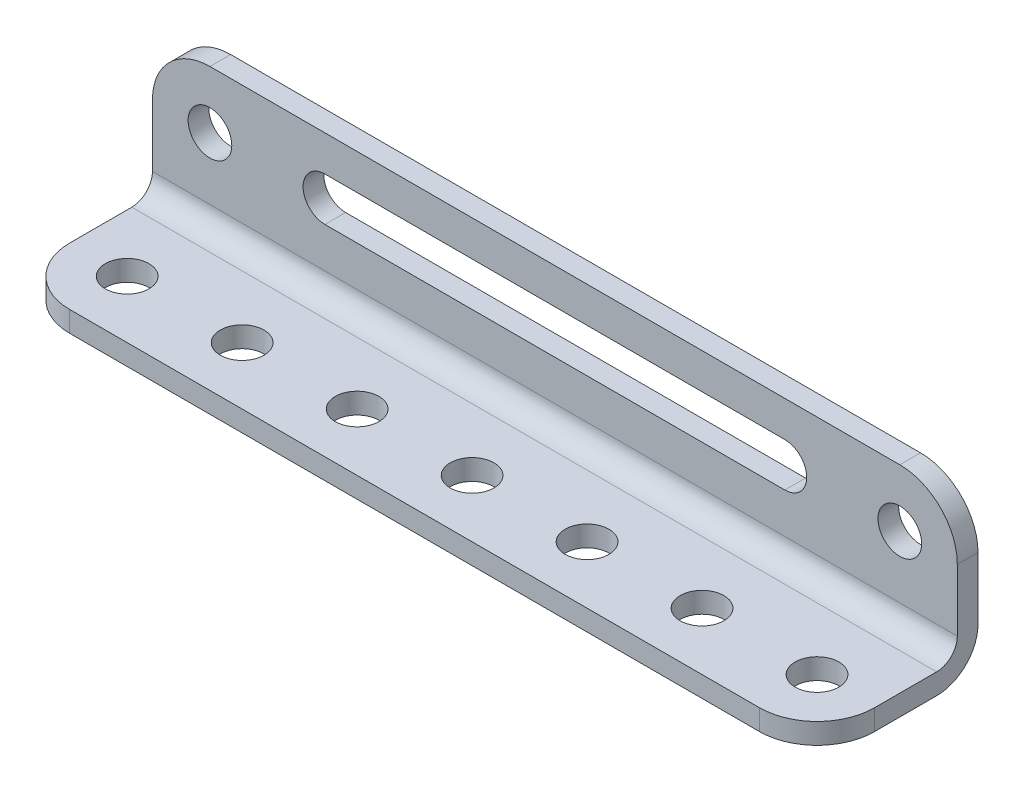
ISO-10303-21;
HEADER;
FILE_DESCRIPTION(('STEP AP214'),'2;1');
FILE_NAME('part.step','',(''),(''),'','','');
FILE_SCHEMA(('AUTOMOTIVE_DESIGN { 1 0 10303 214 1 1 1 1 }'));
ENDSEC;
DATA;
#1=APPLICATION_CONTEXT('core data for automotive mechanical design processes');
#2=APPLICATION_PROTOCOL_DEFINITION('international standard','automotive_design',2000,#1);
#3=PRODUCT_CONTEXT('',#1,'mechanical');
#4=PRODUCT('Part','Part','',(#3));
#5=PRODUCT_RELATED_PRODUCT_CATEGORY('part','',(#4));
#6=PRODUCT_DEFINITION_FORMATION('','',#4);
#7=PRODUCT_DEFINITION_CONTEXT('part definition',#1,'design');
#8=PRODUCT_DEFINITION('design','',#6,#7);
#9=PRODUCT_DEFINITION_SHAPE('','',#8);
#10=(LENGTH_UNIT() NAMED_UNIT(*) SI_UNIT(.MILLI.,.METRE.));
#11=(NAMED_UNIT(*) PLANE_ANGLE_UNIT() SI_UNIT($,.RADIAN.));
#12=(NAMED_UNIT(*) SI_UNIT($,.STERADIAN.) SOLID_ANGLE_UNIT());
#13=UNCERTAINTY_MEASURE_WITH_UNIT(LENGTH_MEASURE(1.E-05),#10,'distance_accuracy_value','');
#14=(GEOMETRIC_REPRESENTATION_CONTEXT(3) GLOBAL_UNCERTAINTY_ASSIGNED_CONTEXT((#13)) GLOBAL_UNIT_ASSIGNED_CONTEXT((#10,
#11,#12)) REPRESENTATION_CONTEXT('',''));
#15=CARTESIAN_POINT('',(0.,0.,0.));
#16=DIRECTION('',(0.,0.,1.));
#17=DIRECTION('',(1.,0.,0.));
#18=AXIS2_PLACEMENT_3D('',#15,#16,#17);
#19=CARTESIAN_POINT('',(44.45,4.572,-17.78));
#20=DIRECTION('',(0.,0.,1.));
#21=DIRECTION('',(1.,0.,0.));
#22=AXIS2_PLACEMENT_3D('',#19,#20,#21);
#23=PLANE('',#22);
#24=DIRECTION('',(-1.,0.,0.));
#25=VECTOR('',#24,1.);
#26=CARTESIAN_POINT('',(-25.4,13.843,-17.78));
#27=LINE('',#26,#25);
#28=CARTESIAN_POINT('',(25.4,13.843,-17.78));
#29=VERTEX_POINT('',#28);
#30=CARTESIAN_POINT('',(-25.4,13.843,-17.78));
#31=VERTEX_POINT('',#30);
#32=EDGE_CURVE('E170',#29,#31,#27,.T.);
#33=ORIENTED_EDGE('',*,*,#32,.T.);
#34=CARTESIAN_POINT('',(-25.4,11.43,-17.78));
#35=DIRECTION('',(0.,0.,1.));
#36=DIRECTION('',(1.,0.,0.));
#37=AXIS2_PLACEMENT_3D('',#34,#35,#36);
#38=CIRCLE('',#37,2.41299999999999);
#39=CARTESIAN_POINT('',(-25.4,9.017,-17.78));
#40=VERTEX_POINT('',#39);
#41=EDGE_CURVE('E161',#31,#40,#38,.T.);
#42=ORIENTED_EDGE('',*,*,#41,.T.);
#43=DIRECTION('',(1.,0.,0.));
#44=VECTOR('',#43,1.);
#45=CARTESIAN_POINT('',(-25.4,9.017,-17.78));
#46=LINE('',#45,#44);
#47=CARTESIAN_POINT('',(25.4,9.017,-17.78));
#48=VERTEX_POINT('',#47);
#49=EDGE_CURVE('E167',#40,#48,#46,.T.);
#50=ORIENTED_EDGE('',*,*,#49,.T.);
#51=CARTESIAN_POINT('',(25.4,11.43,-17.78));
#52=DIRECTION('',(0.,0.,1.));
#53=DIRECTION('',(-1.,0.,0.));
#54=AXIS2_PLACEMENT_3D('',#51,#52,#53);
#55=CIRCLE('',#54,2.41299999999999);
#56=EDGE_CURVE('E44',#48,#29,#55,.T.);
#57=ORIENTED_EDGE('',*,*,#56,.T.);
#58=EDGE_LOOP('',(#33,#42,#50,#57));
#59=FACE_BOUND('',#58,.T.);
#60=CARTESIAN_POINT('',(38.1,11.43,-17.78));
#61=DIRECTION('',(0.,0.,1.));
#62=DIRECTION('',(1.,0.,0.));
#63=AXIS2_PLACEMENT_3D('',#60,#61,#62);
#64=CIRCLE('',#63,2.41299999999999);
#65=CARTESIAN_POINT('',(40.513,11.43,-17.78));
#66=VERTEX_POINT('',#65);
#67=EDGE_CURVE('E175',#66,#66,#64,.T.);
#68=ORIENTED_EDGE('',*,*,#67,.T.);
#69=EDGE_LOOP('',(#68));
#70=FACE_BOUND('',#69,.T.);
#71=CARTESIAN_POINT('',(-38.1,11.43,-17.78));
#72=DIRECTION('',(0.,0.,1.));
#73=DIRECTION('',(1.,0.,0.));
#74=AXIS2_PLACEMENT_3D('',#71,#72,#73);
#75=CIRCLE('',#74,2.41299999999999);
#76=CARTESIAN_POINT('',(-35.687,11.43,-17.78));
#77=VERTEX_POINT('',#76);
#78=EDGE_CURVE('E186',#77,#77,#75,.T.);
#79=ORIENTED_EDGE('',*,*,#78,.T.);
#80=EDGE_LOOP('',(#79));
#81=FACE_BOUND('',#80,.T.);
#82=DIRECTION('',(0.,1.,0.));
#83=VECTOR('',#82,1.);
#84=CARTESIAN_POINT('',(-44.45,4.572,-17.78));
#85=LINE('',#84,#83);
#86=CARTESIAN_POINT('',(-44.45,4.572,-17.78));
#87=VERTEX_POINT('',#86);
#88=CARTESIAN_POINT('',(-44.45,11.43,-17.78));
#89=VERTEX_POINT('',#88);
#90=EDGE_CURVE('E201',#87,#89,#85,.T.);
#91=ORIENTED_EDGE('',*,*,#90,.T.);
#92=CARTESIAN_POINT('',(-38.1,11.43,-17.78));
#93=DIRECTION('',(0.,0.,1.));
#94=DIRECTION('',(1.,0.,0.));
#95=AXIS2_PLACEMENT_3D('',#92,#93,#94);
#96=CIRCLE('',#95,6.35);
#97=CARTESIAN_POINT('',(-38.1,17.78,-17.78));
#98=VERTEX_POINT('',#97);
#99=EDGE_CURVE('E292',#89,#98,#96,.F.);
#100=ORIENTED_EDGE('',*,*,#99,.T.);
#101=DIRECTION('',(-1.,0.,0.));
#102=VECTOR('',#101,1.);
#103=CARTESIAN_POINT('',(44.45,17.78,-17.78));
#104=LINE('',#103,#102);
#105=CARTESIAN_POINT('',(38.1,17.78,-17.78));
#106=VERTEX_POINT('',#105);
#107=EDGE_CURVE('E251',#106,#98,#104,.T.);
#108=ORIENTED_EDGE('',*,*,#107,.F.);
#109=CARTESIAN_POINT('',(38.1,11.43,-17.78));
#110=DIRECTION('',(0.,0.,1.));
#111=DIRECTION('',(1.,0.,0.));
#112=AXIS2_PLACEMENT_3D('',#109,#110,#111);
#113=CIRCLE('',#112,6.35);
#114=CARTESIAN_POINT('',(44.45,11.43,-17.78));
#115=VERTEX_POINT('',#114);
#116=EDGE_CURVE('E290',#106,#115,#113,.F.);
#117=ORIENTED_EDGE('',*,*,#116,.T.);
#118=DIRECTION('',(0.,1.,0.));
#119=VECTOR('',#118,1.);
#120=CARTESIAN_POINT('',(44.45,4.572,-17.78));
#121=LINE('',#120,#119);
#122=CARTESIAN_POINT('',(44.45,4.572,-17.78));
#123=VERTEX_POINT('',#122);
#124=EDGE_CURVE('E216',#123,#115,#121,.T.);
#125=ORIENTED_EDGE('',*,*,#124,.F.);
#126=DIRECTION('',(-1.,0.,0.));
#127=VECTOR('',#126,1.);
#128=CARTESIAN_POINT('',(44.45,4.572,-17.78));
#129=LINE('',#128,#127);
#130=EDGE_CURVE('E231',#123,#87,#129,.T.);
#131=ORIENTED_EDGE('',*,*,#130,.T.);
#132=EDGE_LOOP('',(#91,#100,#108,#117,#125,#131));
#133=FACE_BOUND('',#132,.T.);
#134=ADVANCED_FACE('F29',(#59,#70,#81,#133),#23,.F.);
#135=CARTESIAN_POINT('',(44.45,17.78,-15.494));
#136=DIRECTION('',(0.,1.,0.));
#137=DIRECTION('',(0.,0.,1.));
#138=AXIS2_PLACEMENT_3D('',#135,#136,#137);
#139=PLANE('',#138);
#140=ORIENTED_EDGE('',*,*,#107,.T.);
#141=DIRECTION('',(0.,0.,-1.));
#142=VECTOR('',#141,1.);
#143=CARTESIAN_POINT('',(-38.1,17.78,-15.494));
#144=LINE('',#143,#142);
#145=CARTESIAN_POINT('',(-38.1,17.78,-15.494));
#146=VERTEX_POINT('',#145);
#147=EDGE_CURVE('E297',#98,#146,#144,.F.);
#148=ORIENTED_EDGE('',*,*,#147,.T.);
#149=DIRECTION('',(-1.,0.,0.));
#150=VECTOR('',#149,1.);
#151=CARTESIAN_POINT('',(44.45,17.78,-15.494));
#152=LINE('',#151,#150);
#153=CARTESIAN_POINT('',(38.1,17.78,-15.494));
#154=VERTEX_POINT('',#153);
#155=EDGE_CURVE('E248',#154,#146,#152,.T.);
#156=ORIENTED_EDGE('',*,*,#155,.F.);
#157=DIRECTION('',(0.,0.,-1.));
#158=VECTOR('',#157,1.);
#159=CARTESIAN_POINT('',(38.1,17.78,-15.494));
#160=LINE('',#159,#158);
#161=EDGE_CURVE('E294',#154,#106,#160,.T.);
#162=ORIENTED_EDGE('',*,*,#161,.T.);
#163=EDGE_LOOP('',(#140,#148,#156,#162));
#164=FACE_BOUND('',#163,.T.);
#165=ADVANCED_FACE('F363',(#164),#139,.T.);
#166=CARTESIAN_POINT('',(44.45,4.572,-15.494));
#167=DIRECTION('',(0.,0.,1.));
#168=DIRECTION('',(1.,0.,0.));
#169=AXIS2_PLACEMENT_3D('',#166,#167,#168);
#170=PLANE('',#169);
#171=CARTESIAN_POINT('',(-25.4,11.43,-15.494));
#172=DIRECTION('',(0.,0.,1.));
#173=DIRECTION('',(1.,0.,0.));
#174=AXIS2_PLACEMENT_3D('',#171,#172,#173);
#175=CIRCLE('',#174,2.41299999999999);
#176=CARTESIAN_POINT('',(-25.4,13.843,-15.494));
#177=VERTEX_POINT('',#176);
#178=CARTESIAN_POINT('',(-25.4,9.017,-15.494));
#179=VERTEX_POINT('',#178);
#180=EDGE_CURVE('E52',#177,#179,#175,.T.);
#181=ORIENTED_EDGE('',*,*,#180,.F.);
#182=DIRECTION('',(-1.,0.,0.));
#183=VECTOR('',#182,1.);
#184=CARTESIAN_POINT('',(-25.4,13.843,-15.494));
#185=LINE('',#184,#183);
#186=CARTESIAN_POINT('',(25.4,13.843,-15.494));
#187=VERTEX_POINT('',#186);
#188=EDGE_CURVE('E159',#187,#177,#185,.T.);
#189=ORIENTED_EDGE('',*,*,#188,.F.);
#190=CARTESIAN_POINT('',(25.4,11.43,-15.494));
#191=DIRECTION('',(0.,0.,1.));
#192=DIRECTION('',(-1.,0.,0.));
#193=AXIS2_PLACEMENT_3D('',#190,#191,#192);
#194=CIRCLE('',#193,2.41299999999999);
#195=CARTESIAN_POINT('',(25.4,9.017,-15.494));
#196=VERTEX_POINT('',#195);
#197=EDGE_CURVE('E143',#196,#187,#194,.T.);
#198=ORIENTED_EDGE('',*,*,#197,.F.);
#199=DIRECTION('',(1.,0.,0.));
#200=VECTOR('',#199,1.);
#201=CARTESIAN_POINT('',(-25.4,9.017,-15.494));
#202=LINE('',#201,#200);
#203=EDGE_CURVE('E152',#179,#196,#202,.T.);
#204=ORIENTED_EDGE('',*,*,#203,.F.);
#205=EDGE_LOOP('',(#181,#189,#198,#204));
#206=FACE_BOUND('',#205,.T.);
#207=CARTESIAN_POINT('',(38.1,11.43,-15.494));
#208=DIRECTION('',(0.,0.,1.));
#209=DIRECTION('',(1.,0.,0.));
#210=AXIS2_PLACEMENT_3D('',#207,#208,#209);
#211=CIRCLE('',#210,2.41299999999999);
#212=CARTESIAN_POINT('',(40.513,11.43,-15.494));
#213=VERTEX_POINT('',#212);
#214=EDGE_CURVE('E180',#213,#213,#211,.T.);
#215=ORIENTED_EDGE('',*,*,#214,.F.);
#216=EDGE_LOOP('',(#215));
#217=FACE_BOUND('',#216,.T.);
#218=CARTESIAN_POINT('',(-38.1,11.43,-15.494));
#219=DIRECTION('',(0.,0.,1.));
#220=DIRECTION('',(1.,0.,0.));
#221=AXIS2_PLACEMENT_3D('',#218,#219,#220);
#222=CIRCLE('',#221,2.41299999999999);
#223=CARTESIAN_POINT('',(-35.687,11.43,-15.494));
#224=VERTEX_POINT('',#223);
#225=EDGE_CURVE('E183',#224,#224,#222,.T.);
#226=ORIENTED_EDGE('',*,*,#225,.F.);
#227=EDGE_LOOP('',(#226));
#228=FACE_BOUND('',#227,.T.);
#229=ORIENTED_EDGE('',*,*,#155,.T.);
#230=CARTESIAN_POINT('',(-38.1,11.43,-15.494));
#231=DIRECTION('',(0.,0.,1.));
#232=DIRECTION('',(1.,0.,0.));
#233=AXIS2_PLACEMENT_3D('',#230,#231,#232);
#234=CIRCLE('',#233,6.35);
#235=CARTESIAN_POINT('',(-44.45,11.43,-15.494));
#236=VERTEX_POINT('',#235);
#237=EDGE_CURVE('E301',#146,#236,#234,.T.);
#238=ORIENTED_EDGE('',*,*,#237,.T.);
#239=DIRECTION('',(0.,1.,0.));
#240=VECTOR('',#239,1.);
#241=CARTESIAN_POINT('',(-44.45,4.572,-15.494));
#242=LINE('',#241,#240);
#243=CARTESIAN_POINT('',(-44.45,4.572,-15.494));
#244=VERTEX_POINT('',#243);
#245=EDGE_CURVE('E204',#244,#236,#242,.T.);
#246=ORIENTED_EDGE('',*,*,#245,.F.);
#247=DIRECTION('',(-1.,0.,0.));
#248=VECTOR('',#247,1.);
#249=CARTESIAN_POINT('',(44.45,4.572,-15.494));
#250=LINE('',#249,#248);
#251=CARTESIAN_POINT('',(44.45,4.572,-15.494));
#252=VERTEX_POINT('',#251);
#253=EDGE_CURVE('E246',#252,#244,#250,.T.);
#254=ORIENTED_EDGE('',*,*,#253,.F.);
#255=DIRECTION('',(0.,1.,0.));
#256=VECTOR('',#255,1.);
#257=CARTESIAN_POINT('',(44.45,4.572,-15.494));
#258=LINE('',#257,#256);
#259=CARTESIAN_POINT('',(44.45,11.43,-15.494));
#260=VERTEX_POINT('',#259);
#261=EDGE_CURVE('E219',#252,#260,#258,.T.);
#262=ORIENTED_EDGE('',*,*,#261,.T.);
#263=CARTESIAN_POINT('',(38.1,11.43,-15.494));
#264=DIRECTION('',(0.,0.,1.));
#265=DIRECTION('',(1.,0.,0.));
#266=AXIS2_PLACEMENT_3D('',#263,#264,#265);
#267=CIRCLE('',#266,6.35);
#268=EDGE_CURVE('E299',#260,#154,#267,.T.);
#269=ORIENTED_EDGE('',*,*,#268,.T.);
#270=EDGE_LOOP('',(#229,#238,#246,#254,#262,#269));
#271=FACE_BOUND('',#270,.T.);
#272=ADVANCED_FACE('F156',(#206,#217,#228,#271),#170,.T.);
#273=CARTESIAN_POINT('',(44.45,4.572,-13.208));
#274=DIRECTION('',(-1.,0.,0.));
#275=DIRECTION('',(0.,0.,1.));
#276=AXIS2_PLACEMENT_3D('',#273,#274,#275);
#277=CYLINDRICAL_SURFACE('',#276,2.286);
#278=CARTESIAN_POINT('',(-44.45,4.572,-13.208));
#279=DIRECTION('',(1.,0.,0.));
#280=DIRECTION('',(0.,0.,-1.));
#281=AXIS2_PLACEMENT_3D('',#278,#279,#280);
#282=CIRCLE('',#281,2.286);
#283=CARTESIAN_POINT('',(-44.45,2.286,-13.208));
#284=VERTEX_POINT('',#283);
#285=EDGE_CURVE('E207',#284,#244,#282,.T.);
#286=ORIENTED_EDGE('',*,*,#285,.F.);
#287=DIRECTION('',(-1.,0.,0.));
#288=VECTOR('',#287,1.);
#289=CARTESIAN_POINT('',(44.45,2.286,-13.208));
#290=LINE('',#289,#288);
#291=CARTESIAN_POINT('',(44.45,2.286,-13.208));
#292=VERTEX_POINT('',#291);
#293=EDGE_CURVE('E243',#292,#284,#290,.T.);
#294=ORIENTED_EDGE('',*,*,#293,.F.);
#295=CARTESIAN_POINT('',(44.45,4.572,-13.208));
#296=DIRECTION('',(1.,0.,0.));
#297=DIRECTION('',(0.,0.,-1.));
#298=AXIS2_PLACEMENT_3D('',#295,#296,#297);
#299=CIRCLE('',#298,2.286);
#300=EDGE_CURVE('E222',#292,#252,#299,.T.);
#301=ORIENTED_EDGE('',*,*,#300,.T.);
#302=ORIENTED_EDGE('',*,*,#253,.T.);
#303=EDGE_LOOP('',(#286,#294,#301,#302));
#304=FACE_BOUND('',#303,.T.);
#305=ADVANCED_FACE('F373',(#304),#277,.F.);
#306=CARTESIAN_POINT('',(44.45,2.286,0.));
#307=DIRECTION('',(0.,1.,0.));
#308=DIRECTION('',(0.,0.,1.));
#309=AXIS2_PLACEMENT_3D('',#306,#307,#308);
#310=PLANE('',#309);
#311=CARTESIAN_POINT('',(-25.4,2.286,-6.35));
#312=DIRECTION('',(0.,1.,0.));
#313=DIRECTION('',(0.,0.,1.));
#314=AXIS2_PLACEMENT_3D('',#311,#312,#313);
#315=CIRCLE('',#314,2.413);
#316=CARTESIAN_POINT('',(-25.4,2.286,-3.937));
#317=VERTEX_POINT('',#316);
#318=EDGE_CURVE('E192',#317,#317,#315,.T.);
#319=ORIENTED_EDGE('',*,*,#318,.F.);
#320=EDGE_LOOP('',(#319));
#321=FACE_BOUND('',#320,.T.);
#322=CARTESIAN_POINT('',(-38.1,2.286,-6.35));
#323=DIRECTION('',(0.,1.,0.));
#324=DIRECTION('',(0.,0.,1.));
#325=AXIS2_PLACEMENT_3D('',#322,#323,#324);
#326=CIRCLE('',#325,2.413);
#327=CARTESIAN_POINT('',(-38.1,2.286,-3.937));
#328=VERTEX_POINT('',#327);
#329=EDGE_CURVE('E195',#328,#328,#326,.T.);
#330=ORIENTED_EDGE('',*,*,#329,.F.);
#331=EDGE_LOOP('',(#330));
#332=FACE_BOUND('',#331,.T.);
#333=DIRECTION('',(0.,0.,-1.));
#334=VECTOR('',#333,1.);
#335=CARTESIAN_POINT('',(-44.45,2.286,0.));
#336=LINE('',#335,#334);
#337=CARTESIAN_POINT('',(-44.45,2.286,-6.35));
#338=VERTEX_POINT('',#337);
#339=EDGE_CURVE('E210',#338,#284,#336,.T.);
#340=ORIENTED_EDGE('',*,*,#339,.F.);
#341=CARTESIAN_POINT('',(-38.1,2.286,-6.35));
#342=DIRECTION('',(0.,1.,0.));
#343=DIRECTION('',(0.,0.,1.));
#344=AXIS2_PLACEMENT_3D('',#341,#342,#343);
#345=CIRCLE('',#344,6.35);
#346=CARTESIAN_POINT('',(-38.1,2.286,0.));
#347=VERTEX_POINT('',#346);
#348=EDGE_CURVE('E305',#338,#347,#345,.T.);
#349=ORIENTED_EDGE('',*,*,#348,.T.);
#350=DIRECTION('',(-1.,0.,0.));
#351=VECTOR('',#350,1.);
#352=CARTESIAN_POINT('',(44.45,2.286,0.));
#353=LINE('',#352,#351);
#354=CARTESIAN_POINT('',(38.1,2.286,0.));
#355=VERTEX_POINT('',#354);
#356=EDGE_CURVE('E240',#355,#347,#353,.T.);
#357=ORIENTED_EDGE('',*,*,#356,.F.);
#358=CARTESIAN_POINT('',(38.1,2.286,-6.35));
#359=DIRECTION('',(0.,1.,0.));
#360=DIRECTION('',(0.,0.,1.));
#361=AXIS2_PLACEMENT_3D('',#358,#359,#360);
#362=CIRCLE('',#361,6.35);
#363=CARTESIAN_POINT('',(44.45,2.286,-6.35));
#364=VERTEX_POINT('',#363);
#365=EDGE_CURVE('E303',#355,#364,#362,.T.);
#366=ORIENTED_EDGE('',*,*,#365,.T.);
#367=DIRECTION('',(0.,0.,-1.));
#368=VECTOR('',#367,1.);
#369=CARTESIAN_POINT('',(44.45,2.286,0.));
#370=LINE('',#369,#368);
#371=EDGE_CURVE('E225',#364,#292,#370,.T.);
#372=ORIENTED_EDGE('',*,*,#371,.T.);
#373=ORIENTED_EDGE('',*,*,#293,.T.);
#374=EDGE_LOOP('',(#340,#349,#357,#366,#372,#373));
#375=FACE_BOUND('',#374,.T.);
#376=CARTESIAN_POINT('',(-12.7,2.286,-6.35));
#377=DIRECTION('',(0.,1.,0.));
#378=DIRECTION('',(0.,0.,1.));
#379=AXIS2_PLACEMENT_3D('',#376,#377,#378);
#380=CIRCLE('',#379,2.413);
#381=CARTESIAN_POINT('',(-12.7,2.286,-3.937));
#382=VERTEX_POINT('',#381);
#383=EDGE_CURVE('E257',#382,#382,#380,.T.);
#384=ORIENTED_EDGE('',*,*,#383,.F.);
#385=EDGE_LOOP('',(#384));
#386=FACE_BOUND('',#385,.T.);
#387=CARTESIAN_POINT('',(0.,2.286,-6.35));
#388=DIRECTION('',(0.,1.,0.));
#389=DIRECTION('',(0.,0.,1.));
#390=AXIS2_PLACEMENT_3D('',#387,#388,#389);
#391=CIRCLE('',#390,2.413);
#392=CARTESIAN_POINT('',(0.,2.286,-3.937));
#393=VERTEX_POINT('',#392);
#394=EDGE_CURVE('E263',#393,#393,#391,.T.);
#395=ORIENTED_EDGE('',*,*,#394,.F.);
#396=EDGE_LOOP('',(#395));
#397=FACE_BOUND('',#396,.T.);
#398=CARTESIAN_POINT('',(12.7,2.286,-6.35));
#399=DIRECTION('',(0.,1.,0.));
#400=DIRECTION('',(0.,0.,1.));
#401=AXIS2_PLACEMENT_3D('',#398,#399,#400);
#402=CIRCLE('',#401,2.413);
#403=CARTESIAN_POINT('',(12.7,2.286,-3.937));
#404=VERTEX_POINT('',#403);
#405=EDGE_CURVE('E269',#404,#404,#402,.T.);
#406=ORIENTED_EDGE('',*,*,#405,.F.);
#407=EDGE_LOOP('',(#406));
#408=FACE_BOUND('',#407,.T.);
#409=CARTESIAN_POINT('',(25.4,2.286,-6.35));
#410=DIRECTION('',(0.,1.,0.));
#411=DIRECTION('',(0.,0.,1.));
#412=AXIS2_PLACEMENT_3D('',#409,#410,#411);
#413=CIRCLE('',#412,2.413);
#414=CARTESIAN_POINT('',(25.4,2.286,-3.937));
#415=VERTEX_POINT('',#414);
#416=EDGE_CURVE('E275',#415,#415,#413,.T.);
#417=ORIENTED_EDGE('',*,*,#416,.F.);
#418=EDGE_LOOP('',(#417));
#419=FACE_BOUND('',#418,.T.);
#420=CARTESIAN_POINT('',(38.1,2.286,-6.35));
#421=DIRECTION('',(0.,1.,0.));
#422=DIRECTION('',(0.,0.,1.));
#423=AXIS2_PLACEMENT_3D('',#420,#421,#422);
#424=CIRCLE('',#423,2.413);
#425=CARTESIAN_POINT('',(38.1,2.286,-3.937));
#426=VERTEX_POINT('',#425);
#427=EDGE_CURVE('E281',#426,#426,#424,.T.);
#428=ORIENTED_EDGE('',*,*,#427,.F.);
#429=EDGE_LOOP('',(#428));
#430=FACE_BOUND('',#429,.T.);
#431=ADVANCED_FACE('F337',(#321,#332,#375,#386,#397,#408,#419,#430),#310,.T.);
#432=CARTESIAN_POINT('',(44.45,0.,0.));
#433=DIRECTION('',(0.,0.,1.));
#434=DIRECTION('',(1.,0.,0.));
#435=AXIS2_PLACEMENT_3D('',#432,#433,#434);
#436=PLANE('',#435);
#437=ORIENTED_EDGE('',*,*,#356,.T.);
#438=DIRECTION('',(0.,1.,0.));
#439=VECTOR('',#438,1.);
#440=CARTESIAN_POINT('',(-38.1,0.,0.));
#441=LINE('',#440,#439);
#442=CARTESIAN_POINT('',(-38.1,0.,0.));
#443=VERTEX_POINT('',#442);
#444=EDGE_CURVE('E310',#347,#443,#441,.F.);
#445=ORIENTED_EDGE('',*,*,#444,.T.);
#446=DIRECTION('',(-1.,0.,0.));
#447=VECTOR('',#446,1.);
#448=CARTESIAN_POINT('',(44.45,0.,0.));
#449=LINE('',#448,#447);
#450=CARTESIAN_POINT('',(38.1,0.,0.));
#451=VERTEX_POINT('',#450);
#452=EDGE_CURVE('E237',#451,#443,#449,.T.);
#453=ORIENTED_EDGE('',*,*,#452,.F.);
#454=DIRECTION('',(0.,1.,0.));
#455=VECTOR('',#454,1.);
#456=CARTESIAN_POINT('',(38.1,0.,0.));
#457=LINE('',#456,#455);
#458=EDGE_CURVE('E307',#451,#355,#457,.T.);
#459=ORIENTED_EDGE('',*,*,#458,.T.);
#460=EDGE_LOOP('',(#437,#445,#453,#459));
#461=FACE_BOUND('',#460,.T.);
#462=ADVANCED_FACE('F333',(#461),#436,.T.);
#463=CARTESIAN_POINT('',(44.45,0.,0.));
#464=DIRECTION('',(0.,1.,0.));
#465=DIRECTION('',(0.,0.,1.));
#466=AXIS2_PLACEMENT_3D('',#463,#464,#465);
#467=PLANE('',#466);
#468=CARTESIAN_POINT('',(-25.4,0.,-6.35));
#469=DIRECTION('',(0.,1.,0.));
#470=DIRECTION('',(0.,0.,1.));
#471=AXIS2_PLACEMENT_3D('',#468,#469,#470);
#472=CIRCLE('',#471,2.413);
#473=CARTESIAN_POINT('',(-25.4,0.,-3.937));
#474=VERTEX_POINT('',#473);
#475=EDGE_CURVE('E189',#474,#474,#472,.T.);
#476=ORIENTED_EDGE('',*,*,#475,.T.);
#477=EDGE_LOOP('',(#476));
#478=FACE_BOUND('',#477,.T.);
#479=CARTESIAN_POINT('',(-38.1,0.,-6.35));
#480=DIRECTION('',(0.,1.,0.));
#481=DIRECTION('',(0.,0.,1.));
#482=AXIS2_PLACEMENT_3D('',#479,#480,#481);
#483=CIRCLE('',#482,2.413);
#484=CARTESIAN_POINT('',(-38.1,0.,-3.937));
#485=VERTEX_POINT('',#484);
#486=EDGE_CURVE('E198',#485,#485,#483,.T.);
#487=ORIENTED_EDGE('',*,*,#486,.T.);
#488=EDGE_LOOP('',(#487));
#489=FACE_BOUND('',#488,.T.);
#490=ORIENTED_EDGE('',*,*,#452,.T.);
#491=CARTESIAN_POINT('',(-38.1,0.,-6.35));
#492=DIRECTION('',(0.,1.,0.));
#493=DIRECTION('',(0.,0.,1.));
#494=AXIS2_PLACEMENT_3D('',#491,#492,#493);
#495=CIRCLE('',#494,6.35);
#496=CARTESIAN_POINT('',(-44.45,0.,-6.35));
#497=VERTEX_POINT('',#496);
#498=EDGE_CURVE('E314',#443,#497,#495,.F.);
#499=ORIENTED_EDGE('',*,*,#498,.T.);
#500=DIRECTION('',(0.,0.,-1.));
#501=VECTOR('',#500,1.);
#502=CARTESIAN_POINT('',(-44.45,0.,0.));
#503=LINE('',#502,#501);
#504=CARTESIAN_POINT('',(-44.45,0.,-13.208));
#505=VERTEX_POINT('',#504);
#506=EDGE_CURVE('E212',#497,#505,#503,.T.);
#507=ORIENTED_EDGE('',*,*,#506,.T.);
#508=DIRECTION('',(-1.,0.,0.));
#509=VECTOR('',#508,1.);
#510=CARTESIAN_POINT('',(44.45,0.,-13.208));
#511=LINE('',#510,#509);
#512=CARTESIAN_POINT('',(44.45,0.,-13.208));
#513=VERTEX_POINT('',#512);
#514=EDGE_CURVE('E234',#513,#505,#511,.T.);
#515=ORIENTED_EDGE('',*,*,#514,.F.);
#516=DIRECTION('',(0.,0.,-1.));
#517=VECTOR('',#516,1.);
#518=CARTESIAN_POINT('',(44.45,0.,0.));
#519=LINE('',#518,#517);
#520=CARTESIAN_POINT('',(44.45,0.,-6.35));
#521=VERTEX_POINT('',#520);
#522=EDGE_CURVE('E227',#521,#513,#519,.T.);
#523=ORIENTED_EDGE('',*,*,#522,.F.);
#524=CARTESIAN_POINT('',(38.1,0.,-6.35));
#525=DIRECTION('',(0.,1.,0.));
#526=DIRECTION('',(0.,0.,1.));
#527=AXIS2_PLACEMENT_3D('',#524,#525,#526);
#528=CIRCLE('',#527,6.35);
#529=EDGE_CURVE('E312',#521,#451,#528,.F.);
#530=ORIENTED_EDGE('',*,*,#529,.T.);
#531=EDGE_LOOP('',(#490,#499,#507,#515,#523,#530));
#532=FACE_BOUND('',#531,.T.);
#533=CARTESIAN_POINT('',(-12.7,0.,-6.35));
#534=DIRECTION('',(0.,1.,0.));
#535=DIRECTION('',(0.,0.,1.));
#536=AXIS2_PLACEMENT_3D('',#533,#534,#535);
#537=CIRCLE('',#536,2.413);
#538=CARTESIAN_POINT('',(-12.7,0.,-3.937));
#539=VERTEX_POINT('',#538);
#540=EDGE_CURVE('E254',#539,#539,#537,.T.);
#541=ORIENTED_EDGE('',*,*,#540,.T.);
#542=EDGE_LOOP('',(#541));
#543=FACE_BOUND('',#542,.T.);
#544=CARTESIAN_POINT('',(0.,0.,-6.35));
#545=DIRECTION('',(0.,1.,0.));
#546=DIRECTION('',(0.,0.,1.));
#547=AXIS2_PLACEMENT_3D('',#544,#545,#546);
#548=CIRCLE('',#547,2.413);
#549=CARTESIAN_POINT('',(0.,0.,-3.937));
#550=VERTEX_POINT('',#549);
#551=EDGE_CURVE('E260',#550,#550,#548,.T.);
#552=ORIENTED_EDGE('',*,*,#551,.T.);
#553=EDGE_LOOP('',(#552));
#554=FACE_BOUND('',#553,.T.);
#555=CARTESIAN_POINT('',(12.7,0.,-6.35));
#556=DIRECTION('',(0.,1.,0.));
#557=DIRECTION('',(0.,0.,1.));
#558=AXIS2_PLACEMENT_3D('',#555,#556,#557);
#559=CIRCLE('',#558,2.413);
#560=CARTESIAN_POINT('',(12.7,0.,-3.937));
#561=VERTEX_POINT('',#560);
#562=EDGE_CURVE('E266',#561,#561,#559,.T.);
#563=ORIENTED_EDGE('',*,*,#562,.T.);
#564=EDGE_LOOP('',(#563));
#565=FACE_BOUND('',#564,.T.);
#566=CARTESIAN_POINT('',(25.4,0.,-6.35));
#567=DIRECTION('',(0.,1.,0.));
#568=DIRECTION('',(0.,0.,1.));
#569=AXIS2_PLACEMENT_3D('',#566,#567,#568);
#570=CIRCLE('',#569,2.413);
#571=CARTESIAN_POINT('',(25.4,0.,-3.937));
#572=VERTEX_POINT('',#571);
#573=EDGE_CURVE('E272',#572,#572,#570,.T.);
#574=ORIENTED_EDGE('',*,*,#573,.T.);
#575=EDGE_LOOP('',(#574));
#576=FACE_BOUND('',#575,.T.);
#577=CARTESIAN_POINT('',(38.1,0.,-6.35));
#578=DIRECTION('',(0.,1.,0.));
#579=DIRECTION('',(0.,0.,1.));
#580=AXIS2_PLACEMENT_3D('',#577,#578,#579);
#581=CIRCLE('',#580,2.413);
#582=CARTESIAN_POINT('',(38.1,0.,-3.937));
#583=VERTEX_POINT('',#582);
#584=EDGE_CURVE('E278',#583,#583,#581,.T.);
#585=ORIENTED_EDGE('',*,*,#584,.T.);
#586=EDGE_LOOP('',(#585));
#587=FACE_BOUND('',#586,.T.);
#588=ADVANCED_FACE('F325',(#478,#489,#532,#543,#554,#565,#576,#587),#467,.F.);
#589=CARTESIAN_POINT('',(44.45,4.572,-13.208));
#590=DIRECTION('',(-1.,0.,0.));
#591=DIRECTION('',(0.,0.,1.));
#592=AXIS2_PLACEMENT_3D('',#589,#590,#591);
#593=CYLINDRICAL_SURFACE('',#592,4.572);
#594=CARTESIAN_POINT('',(-44.45,4.572,-13.208));
#595=DIRECTION('',(1.,0.,0.));
#596=DIRECTION('',(0.,0.,-1.));
#597=AXIS2_PLACEMENT_3D('',#594,#595,#596);
#598=CIRCLE('',#597,4.572);
#599=EDGE_CURVE('E214',#505,#87,#598,.T.);
#600=ORIENTED_EDGE('',*,*,#599,.T.);
#601=ORIENTED_EDGE('',*,*,#130,.F.);
#602=CARTESIAN_POINT('',(44.45,4.572,-13.208));
#603=DIRECTION('',(1.,0.,0.));
#604=DIRECTION('',(0.,0.,-1.));
#605=AXIS2_PLACEMENT_3D('',#602,#603,#604);
#606=CIRCLE('',#605,4.572);
#607=EDGE_CURVE('E229',#513,#123,#606,.T.);
#608=ORIENTED_EDGE('',*,*,#607,.F.);
#609=ORIENTED_EDGE('',*,*,#514,.T.);
#610=EDGE_LOOP('',(#600,#601,#608,#609));
#611=FACE_BOUND('',#610,.T.);
#612=ADVANCED_FACE('F349',(#611),#593,.T.);
#613=CARTESIAN_POINT('',(44.45,4.572,-13.208));
#614=DIRECTION('',(1.,0.,0.));
#615=DIRECTION('',(0.,0.,-1.));
#616=AXIS2_PLACEMENT_3D('',#613,#614,#615);
#617=PLANE('',#616);
#618=ORIENTED_EDGE('',*,*,#124,.T.);
#619=DIRECTION('',(0.,0.,-1.));
#620=VECTOR('',#619,1.);
#621=CARTESIAN_POINT('',(44.45,11.43,-13.208));
#622=LINE('',#621,#620);
#623=EDGE_CURVE('E11',#115,#260,#622,.F.);
#624=ORIENTED_EDGE('',*,*,#623,.T.);
#625=ORIENTED_EDGE('',*,*,#261,.F.);
#626=ORIENTED_EDGE('',*,*,#300,.F.);
#627=ORIENTED_EDGE('',*,*,#371,.F.);
#628=DIRECTION('',(0.,1.,0.));
#629=VECTOR('',#628,1.);
#630=CARTESIAN_POINT('',(44.45,4.572,-6.35));
#631=LINE('',#630,#629);
#632=EDGE_CURVE('E37',#364,#521,#631,.F.);
#633=ORIENTED_EDGE('',*,*,#632,.T.);
#634=ORIENTED_EDGE('',*,*,#522,.T.);
#635=ORIENTED_EDGE('',*,*,#607,.T.);
#636=EDGE_LOOP('',(#618,#624,#625,#626,#627,#633,#634,#635));
#637=FACE_BOUND('',#636,.T.);
#638=ADVANCED_FACE('F319',(#637),#617,.T.);
#639=CARTESIAN_POINT('',(-44.45,4.572,-13.208));
#640=DIRECTION('',(1.,0.,0.));
#641=DIRECTION('',(0.,0.,-1.));
#642=AXIS2_PLACEMENT_3D('',#639,#640,#641);
#643=PLANE('',#642);
#644=ORIENTED_EDGE('',*,*,#245,.T.);
#645=DIRECTION('',(0.,0.,-1.));
#646=VECTOR('',#645,1.);
#647=CARTESIAN_POINT('',(-44.45,11.43,-17.78));
#648=LINE('',#647,#646);
#649=EDGE_CURVE('E287',#236,#89,#648,.T.);
#650=ORIENTED_EDGE('',*,*,#649,.T.);
#651=ORIENTED_EDGE('',*,*,#90,.F.);
#652=ORIENTED_EDGE('',*,*,#599,.F.);
#653=ORIENTED_EDGE('',*,*,#506,.F.);
#654=DIRECTION('',(0.,1.,0.));
#655=VECTOR('',#654,1.);
#656=CARTESIAN_POINT('',(-44.45,2.286,-6.35));
#657=LINE('',#656,#655);
#658=EDGE_CURVE('E284',#497,#338,#657,.T.);
#659=ORIENTED_EDGE('',*,*,#658,.T.);
#660=ORIENTED_EDGE('',*,*,#339,.T.);
#661=ORIENTED_EDGE('',*,*,#285,.T.);
#662=EDGE_LOOP('',(#644,#650,#651,#652,#653,#659,#660,#661));
#663=FACE_BOUND('',#662,.T.);
#664=ADVANCED_FACE('F345',(#663),#643,.F.);
#665=CARTESIAN_POINT('',(-38.1,0.,-6.35));
#666=DIRECTION('',(0.,1.,0.));
#667=DIRECTION('',(0.,0.,1.));
#668=AXIS2_PLACEMENT_3D('',#665,#666,#667);
#669=CYLINDRICAL_SURFACE('',#668,2.413);
#670=ORIENTED_EDGE('',*,*,#486,.F.);
#671=EDGE_LOOP('',(#670));
#672=FACE_BOUND('',#671,.T.);
#673=ORIENTED_EDGE('',*,*,#329,.T.);
#674=EDGE_LOOP('',(#673));
#675=FACE_BOUND('',#674,.T.);
#676=ADVANCED_FACE('F437',(#672,#675),#669,.F.);
#677=CARTESIAN_POINT('',(-25.4,0.,-6.35));
#678=DIRECTION('',(0.,1.,0.));
#679=DIRECTION('',(0.,0.,1.));
#680=AXIS2_PLACEMENT_3D('',#677,#678,#679);
#681=CYLINDRICAL_SURFACE('',#680,2.413);
#682=ORIENTED_EDGE('',*,*,#475,.F.);
#683=EDGE_LOOP('',(#682));
#684=FACE_BOUND('',#683,.T.);
#685=ORIENTED_EDGE('',*,*,#318,.T.);
#686=EDGE_LOOP('',(#685));
#687=FACE_BOUND('',#686,.T.);
#688=ADVANCED_FACE('F398',(#684,#687),#681,.F.);
#689=CARTESIAN_POINT('',(-12.7,0.,-6.35));
#690=DIRECTION('',(0.,1.,0.));
#691=DIRECTION('',(0.,0.,1.));
#692=AXIS2_PLACEMENT_3D('',#689,#690,#691);
#693=CYLINDRICAL_SURFACE('',#692,2.413);
#694=ORIENTED_EDGE('',*,*,#540,.F.);
#695=EDGE_LOOP('',(#694));
#696=FACE_BOUND('',#695,.T.);
#697=ORIENTED_EDGE('',*,*,#383,.T.);
#698=EDGE_LOOP('',(#697));
#699=FACE_BOUND('',#698,.T.);
#700=ADVANCED_FACE('F394',(#696,#699),#693,.F.);
#701=CARTESIAN_POINT('',(0.,0.,-6.35));
#702=DIRECTION('',(0.,1.,0.));
#703=DIRECTION('',(0.,0.,1.));
#704=AXIS2_PLACEMENT_3D('',#701,#702,#703);
#705=CYLINDRICAL_SURFACE('',#704,2.413);
#706=ORIENTED_EDGE('',*,*,#551,.F.);
#707=EDGE_LOOP('',(#706));
#708=FACE_BOUND('',#707,.T.);
#709=ORIENTED_EDGE('',*,*,#394,.T.);
#710=EDGE_LOOP('',(#709));
#711=FACE_BOUND('',#710,.T.);
#712=ADVANCED_FACE('F397',(#708,#711),#705,.F.);
#713=CARTESIAN_POINT('',(12.7,0.,-6.35));
#714=DIRECTION('',(0.,1.,0.));
#715=DIRECTION('',(0.,0.,1.));
#716=AXIS2_PLACEMENT_3D('',#713,#714,#715);
#717=CYLINDRICAL_SURFACE('',#716,2.413);
#718=ORIENTED_EDGE('',*,*,#562,.F.);
#719=EDGE_LOOP('',(#718));
#720=FACE_BOUND('',#719,.T.);
#721=ORIENTED_EDGE('',*,*,#405,.T.);
#722=EDGE_LOOP('',(#721));
#723=FACE_BOUND('',#722,.T.);
#724=ADVANCED_FACE('F402',(#720,#723),#717,.F.);
#725=CARTESIAN_POINT('',(25.4,0.,-6.35));
#726=DIRECTION('',(0.,1.,0.));
#727=DIRECTION('',(0.,0.,1.));
#728=AXIS2_PLACEMENT_3D('',#725,#726,#727);
#729=CYLINDRICAL_SURFACE('',#728,2.413);
#730=ORIENTED_EDGE('',*,*,#573,.F.);
#731=EDGE_LOOP('',(#730));
#732=FACE_BOUND('',#731,.T.);
#733=ORIENTED_EDGE('',*,*,#416,.T.);
#734=EDGE_LOOP('',(#733));
#735=FACE_BOUND('',#734,.T.);
#736=ADVANCED_FACE('F405',(#732,#735),#729,.F.);
#737=CARTESIAN_POINT('',(38.1,0.,-6.35));
#738=DIRECTION('',(0.,1.,0.));
#739=DIRECTION('',(0.,0.,1.));
#740=AXIS2_PLACEMENT_3D('',#737,#738,#739);
#741=CYLINDRICAL_SURFACE('',#740,2.413);
#742=ORIENTED_EDGE('',*,*,#584,.F.);
#743=EDGE_LOOP('',(#742));
#744=FACE_BOUND('',#743,.T.);
#745=ORIENTED_EDGE('',*,*,#427,.T.);
#746=EDGE_LOOP('',(#745));
#747=FACE_BOUND('',#746,.T.);
#748=ADVANCED_FACE('F31',(#744,#747),#741,.F.);
#749=CARTESIAN_POINT('',(-38.1,11.43,-13.208));
#750=DIRECTION('',(0.,0.,1.));
#751=DIRECTION('',(1.,0.,0.));
#752=AXIS2_PLACEMENT_3D('',#749,#750,#751);
#753=CYLINDRICAL_SURFACE('',#752,6.35);
#754=ORIENTED_EDGE('',*,*,#237,.F.);
#755=ORIENTED_EDGE('',*,*,#147,.F.);
#756=ORIENTED_EDGE('',*,*,#99,.F.);
#757=ORIENTED_EDGE('',*,*,#649,.F.);
#758=EDGE_LOOP('',(#754,#755,#756,#757));
#759=FACE_BOUND('',#758,.T.);
#760=ADVANCED_FACE('F367',(#759),#753,.T.);
#761=CARTESIAN_POINT('',(-38.1,4.572,-6.35));
#762=DIRECTION('',(0.,-1.,0.));
#763=DIRECTION('',(0.,0.,-1.));
#764=AXIS2_PLACEMENT_3D('',#761,#762,#763);
#765=CYLINDRICAL_SURFACE('',#764,6.35);
#766=ORIENTED_EDGE('',*,*,#498,.F.);
#767=ORIENTED_EDGE('',*,*,#444,.F.);
#768=ORIENTED_EDGE('',*,*,#348,.F.);
#769=ORIENTED_EDGE('',*,*,#658,.F.);
#770=EDGE_LOOP('',(#766,#767,#768,#769));
#771=FACE_BOUND('',#770,.T.);
#772=ADVANCED_FACE('F342',(#771),#765,.T.);
#773=CARTESIAN_POINT('',(38.1,11.43,-15.494));
#774=DIRECTION('',(0.,0.,-1.));
#775=DIRECTION('',(-1.,0.,0.));
#776=AXIS2_PLACEMENT_3D('',#773,#774,#775);
#777=CYLINDRICAL_SURFACE('',#776,6.35);
#778=ORIENTED_EDGE('',*,*,#268,.F.);
#779=ORIENTED_EDGE('',*,*,#623,.F.);
#780=ORIENTED_EDGE('',*,*,#116,.F.);
#781=ORIENTED_EDGE('',*,*,#161,.F.);
#782=EDGE_LOOP('',(#778,#779,#780,#781));
#783=FACE_BOUND('',#782,.T.);
#784=ADVANCED_FACE('F357',(#783),#777,.T.);
#785=CARTESIAN_POINT('',(38.1,0.,-6.35));
#786=DIRECTION('',(0.,1.,0.));
#787=DIRECTION('',(0.,0.,1.));
#788=AXIS2_PLACEMENT_3D('',#785,#786,#787);
#789=CYLINDRICAL_SURFACE('',#788,6.35);
#790=ORIENTED_EDGE('',*,*,#529,.F.);
#791=ORIENTED_EDGE('',*,*,#632,.F.);
#792=ORIENTED_EDGE('',*,*,#365,.F.);
#793=ORIENTED_EDGE('',*,*,#458,.F.);
#794=EDGE_LOOP('',(#790,#791,#792,#793));
#795=FACE_BOUND('',#794,.T.);
#796=ADVANCED_FACE('F330',(#795),#789,.T.);
#797=CARTESIAN_POINT('',(-38.1,11.43,-17.78));
#798=DIRECTION('',(0.,0.,1.));
#799=DIRECTION('',(1.,0.,0.));
#800=AXIS2_PLACEMENT_3D('',#797,#798,#799);
#801=CYLINDRICAL_SURFACE('',#800,2.41299999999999);
#802=ORIENTED_EDGE('',*,*,#78,.F.);
#803=EDGE_LOOP('',(#802));
#804=FACE_BOUND('',#803,.T.);
#805=ORIENTED_EDGE('',*,*,#225,.T.);
#806=EDGE_LOOP('',(#805));
#807=FACE_BOUND('',#806,.T.);
#808=ADVANCED_FACE('F452',(#804,#807),#801,.F.);
#809=CARTESIAN_POINT('',(38.1,11.43,-17.78));
#810=DIRECTION('',(0.,0.,1.));
#811=DIRECTION('',(1.,0.,0.));
#812=AXIS2_PLACEMENT_3D('',#809,#810,#811);
#813=CYLINDRICAL_SURFACE('',#812,2.41299999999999);
#814=ORIENTED_EDGE('',*,*,#67,.F.);
#815=EDGE_LOOP('',(#814));
#816=FACE_BOUND('',#815,.T.);
#817=ORIENTED_EDGE('',*,*,#214,.T.);
#818=EDGE_LOOP('',(#817));
#819=FACE_BOUND('',#818,.T.);
#820=ADVANCED_FACE('F455',(#816,#819),#813,.F.);
#821=CARTESIAN_POINT('',(-25.4,11.43,-17.78));
#822=DIRECTION('',(0.,0.,1.));
#823=DIRECTION('',(1.,0.,0.));
#824=AXIS2_PLACEMENT_3D('',#821,#822,#823);
#825=CYLINDRICAL_SURFACE('',#824,2.41299999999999);
#826=ORIENTED_EDGE('',*,*,#180,.T.);
#827=DIRECTION('',(0.,0.,1.));
#828=VECTOR('',#827,1.);
#829=CARTESIAN_POINT('',(-25.4,9.017,-17.78));
#830=LINE('',#829,#828);
#831=EDGE_CURVE('E149',#40,#179,#830,.T.);
#832=ORIENTED_EDGE('',*,*,#831,.F.);
#833=ORIENTED_EDGE('',*,*,#41,.F.);
#834=DIRECTION('',(0.,0.,1.));
#835=VECTOR('',#834,1.);
#836=CARTESIAN_POINT('',(-25.4,13.843,-17.78));
#837=LINE('',#836,#835);
#838=EDGE_CURVE('E173',#31,#177,#837,.T.);
#839=ORIENTED_EDGE('',*,*,#838,.T.);
#840=EDGE_LOOP('',(#826,#832,#833,#839));
#841=FACE_BOUND('',#840,.T.);
#842=ADVANCED_FACE('F458',(#841),#825,.F.);
#843=CARTESIAN_POINT('',(-25.4,13.843,-17.78));
#844=DIRECTION('',(0.,1.,0.));
#845=DIRECTION('',(0.,0.,1.));
#846=AXIS2_PLACEMENT_3D('',#843,#844,#845);
#847=PLANE('',#846);
#848=ORIENTED_EDGE('',*,*,#188,.T.);
#849=ORIENTED_EDGE('',*,*,#838,.F.);
#850=ORIENTED_EDGE('',*,*,#32,.F.);
#851=DIRECTION('',(0.,0.,1.));
#852=VECTOR('',#851,1.);
#853=CARTESIAN_POINT('',(25.4,13.843,-17.78));
#854=LINE('',#853,#852);
#855=EDGE_CURVE('E148',#29,#187,#854,.T.);
#856=ORIENTED_EDGE('',*,*,#855,.T.);
#857=EDGE_LOOP('',(#848,#849,#850,#856));
#858=FACE_BOUND('',#857,.T.);
#859=ADVANCED_FACE('F462',(#858),#847,.F.);
#860=CARTESIAN_POINT('',(25.4,11.43,-17.78));
#861=DIRECTION('',(0.,0.,1.));
#862=DIRECTION('',(1.,0.,0.));
#863=AXIS2_PLACEMENT_3D('',#860,#861,#862);
#864=CYLINDRICAL_SURFACE('',#863,2.41299999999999);
#865=ORIENTED_EDGE('',*,*,#197,.T.);
#866=ORIENTED_EDGE('',*,*,#855,.F.);
#867=ORIENTED_EDGE('',*,*,#56,.F.);
#868=DIRECTION('',(0.,0.,1.));
#869=VECTOR('',#868,1.);
#870=CARTESIAN_POINT('',(25.4,9.017,-17.78));
#871=LINE('',#870,#869);
#872=EDGE_CURVE('E139',#48,#196,#871,.T.);
#873=ORIENTED_EDGE('',*,*,#872,.T.);
#874=EDGE_LOOP('',(#865,#866,#867,#873));
#875=FACE_BOUND('',#874,.T.);
#876=ADVANCED_FACE('F141',(#875),#864,.F.);
#877=CARTESIAN_POINT('',(-25.4,9.017,-17.78));
#878=DIRECTION('',(0.,-1.,0.));
#879=DIRECTION('',(0.,0.,-1.));
#880=AXIS2_PLACEMENT_3D('',#877,#878,#879);
#881=PLANE('',#880);
#882=ORIENTED_EDGE('',*,*,#203,.T.);
#883=ORIENTED_EDGE('',*,*,#872,.F.);
#884=ORIENTED_EDGE('',*,*,#49,.F.);
#885=ORIENTED_EDGE('',*,*,#831,.T.);
#886=EDGE_LOOP('',(#882,#883,#884,#885));
#887=FACE_BOUND('',#886,.T.);
#888=ADVANCED_FACE('F153',(#887),#881,.F.);
#889=CLOSED_SHELL('',(#134,#165,#272,#305,#431,#462,#588,#612,#638,#664,#676,#688,#700,#712,
#724,#736,#748,#760,#772,#784,#796,#808,#820,#842,#859,#876,#888));
#890=MANIFOLD_SOLID_BREP('B2',#889);
#891=ADVANCED_BREP_SHAPE_REPRESENTATION('',(#18,#890),#14);
#892=SHAPE_DEFINITION_REPRESENTATION(#9,#891);
ENDSEC;
END-ISO-10303-21;
